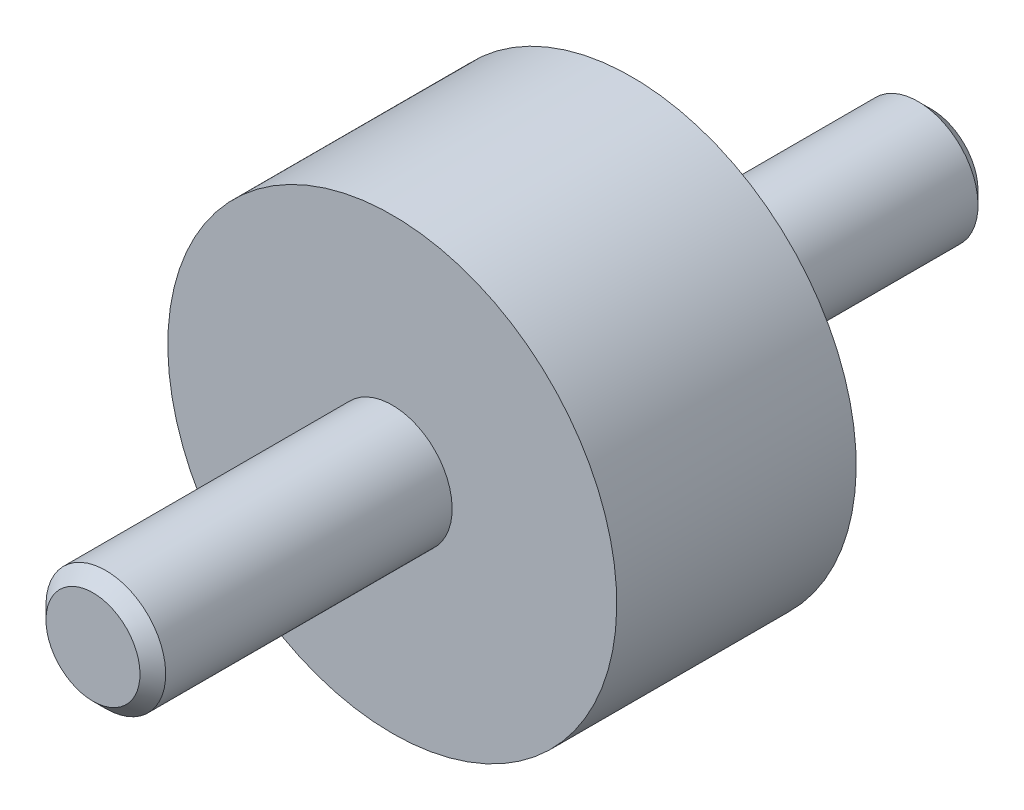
ISO-10303-21;
HEADER;
FILE_DESCRIPTION(('STEP AP214'),'2;1');
FILE_NAME('part.step','',(''),(''),'','','');
FILE_SCHEMA(('AUTOMOTIVE_DESIGN { 1 0 10303 214 1 1 1 1 }'));
ENDSEC;
DATA;
#1=APPLICATION_CONTEXT('core data for automotive mechanical design processes');
#2=APPLICATION_PROTOCOL_DEFINITION('international standard','automotive_design',2000,#1);
#3=PRODUCT_CONTEXT('',#1,'mechanical');
#4=PRODUCT('Part','Part','',(#3));
#5=PRODUCT_RELATED_PRODUCT_CATEGORY('part','',(#4));
#6=PRODUCT_DEFINITION_FORMATION('','',#4);
#7=PRODUCT_DEFINITION_CONTEXT('part definition',#1,'design');
#8=PRODUCT_DEFINITION('design','',#6,#7);
#9=PRODUCT_DEFINITION_SHAPE('','',#8);
#10=(LENGTH_UNIT() NAMED_UNIT(*) SI_UNIT(.MILLI.,.METRE.));
#11=(NAMED_UNIT(*) PLANE_ANGLE_UNIT() SI_UNIT($,.RADIAN.));
#12=(NAMED_UNIT(*) SI_UNIT($,.STERADIAN.) SOLID_ANGLE_UNIT());
#13=UNCERTAINTY_MEASURE_WITH_UNIT(LENGTH_MEASURE(1.E-05),#10,'distance_accuracy_value','');
#14=(GEOMETRIC_REPRESENTATION_CONTEXT(3) GLOBAL_UNCERTAINTY_ASSIGNED_CONTEXT((#13)) GLOBAL_UNIT_ASSIGNED_CONTEXT((#10,
#11,#12)) REPRESENTATION_CONTEXT('',''));
#15=CARTESIAN_POINT('',(0.,0.,0.));
#16=DIRECTION('',(0.,0.,1.));
#17=DIRECTION('',(1.,0.,0.));
#18=AXIS2_PLACEMENT_3D('',#15,#16,#17);
#19=CARTESIAN_POINT('',(7.,0.,8.));
#20=DIRECTION('',(0.,0.,1.));
#21=DIRECTION('',(0.,-1.,0.));
#22=AXIS2_PLACEMENT_3D('',#19,#20,#21);
#23=PLANE('',#22);
#24=CARTESIAN_POINT('',(0.,0.,8.));
#25=DIRECTION('',(0.,0.,1.));
#26=DIRECTION('',(0.,-1.,0.));
#27=AXIS2_PLACEMENT_3D('',#24,#25,#26);
#28=CIRCLE('',#27,2.);
#29=CARTESIAN_POINT('',(0.,-2.,8.));
#30=VERTEX_POINT('',#29);
#31=EDGE_CURVE('E8',#30,#30,#28,.T.);
#32=ORIENTED_EDGE('',*,*,#31,.F.);
#33=EDGE_LOOP('',(#32));
#34=FACE_BOUND('',#33,.T.);
#35=CARTESIAN_POINT('',(0.,0.,8.));
#36=DIRECTION('',(0.,0.,1.));
#37=DIRECTION('',(0.,-1.,0.));
#38=AXIS2_PLACEMENT_3D('',#35,#36,#37);
#39=CIRCLE('',#38,7.5);
#40=CARTESIAN_POINT('',(0.,-7.5,8.));
#41=VERTEX_POINT('',#40);
#42=EDGE_CURVE('E22',#41,#41,#39,.T.);
#43=ORIENTED_EDGE('',*,*,#42,.T.);
#44=EDGE_LOOP('',(#43));
#45=FACE_BOUND('',#44,.T.);
#46=ADVANCED_FACE('F12',(#34,#45),#23,.T.);
#47=CARTESIAN_POINT('',(0.,0.,0.26666666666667));
#48=DIRECTION('',(0.,0.,1.));
#49=DIRECTION('',(0.,-1.,0.));
#50=AXIS2_PLACEMENT_3D('',#47,#48,#49);
#51=CYLINDRICAL_SURFACE('',#50,7.5);
#52=CARTESIAN_POINT('',(0.,0.,0.));
#53=DIRECTION('',(0.,0.,1.));
#54=DIRECTION('',(0.,-1.,0.));
#55=AXIS2_PLACEMENT_3D('',#52,#53,#54);
#56=CIRCLE('',#55,7.5);
#57=CARTESIAN_POINT('',(0.,-7.5,0.));
#58=VERTEX_POINT('',#57);
#59=EDGE_CURVE('E26',#58,#58,#56,.T.);
#60=ORIENTED_EDGE('',*,*,#59,.T.);
#61=EDGE_LOOP('',(#60));
#62=FACE_BOUND('',#61,.T.);
#63=ORIENTED_EDGE('',*,*,#42,.F.);
#64=EDGE_LOOP('',(#63));
#65=FACE_BOUND('',#64,.T.);
#66=ADVANCED_FACE('F57',(#62,#65),#51,.T.);
#67=CARTESIAN_POINT('',(7.5,0.,0.));
#68=DIRECTION('',(0.,0.,-1.));
#69=DIRECTION('',(0.,1.,0.));
#70=AXIS2_PLACEMENT_3D('',#67,#68,#69);
#71=PLANE('',#70);
#72=CARTESIAN_POINT('',(0.,0.,0.));
#73=DIRECTION('',(0.,0.,-1.));
#74=DIRECTION('',(0.,1.,0.));
#75=AXIS2_PLACEMENT_3D('',#72,#73,#74);
#76=CIRCLE('',#75,2.);
#77=CARTESIAN_POINT('',(0.,2.,0.));
#78=VERTEX_POINT('',#77);
#79=EDGE_CURVE('E18',#78,#78,#76,.T.);
#80=ORIENTED_EDGE('',*,*,#79,.F.);
#81=EDGE_LOOP('',(#80));
#82=FACE_BOUND('',#81,.T.);
#83=ORIENTED_EDGE('',*,*,#59,.F.);
#84=EDGE_LOOP('',(#83));
#85=FACE_BOUND('',#84,.T.);
#86=ADVANCED_FACE('F62',(#82,#85),#71,.T.);
#87=CARTESIAN_POINT('',(0.,0.,-10.));
#88=DIRECTION('',(0.,0.,1.));
#89=DIRECTION('',(0.,-1.,0.));
#90=AXIS2_PLACEMENT_3D('',#87,#88,#89);
#91=CYLINDRICAL_SURFACE('',#90,2.);
#92=CARTESIAN_POINT('',(0.,0.,-9.5705));
#93=DIRECTION('',(0.,0.,1.));
#94=DIRECTION('',(0.,-1.,0.));
#95=AXIS2_PLACEMENT_3D('',#92,#93,#94);
#96=CIRCLE('',#95,2.);
#97=CARTESIAN_POINT('',(0.,-2.,-9.5705));
#98=VERTEX_POINT('',#97);
#99=EDGE_CURVE('E31',#98,#98,#96,.T.);
#100=ORIENTED_EDGE('',*,*,#99,.T.);
#101=EDGE_LOOP('',(#100));
#102=FACE_BOUND('',#101,.T.);
#103=ORIENTED_EDGE('',*,*,#79,.T.);
#104=EDGE_LOOP('',(#103));
#105=FACE_BOUND('',#104,.T.);
#106=ADVANCED_FACE('F70',(#102,#105),#91,.T.);
#107=CARTESIAN_POINT('',(0.,0.,-9.5705));
#108=DIRECTION('',(0.,0.,1.));
#109=DIRECTION('',(0.,-1.,0.));
#110=AXIS2_PLACEMENT_3D('',#107,#108,#109);
#111=CONICAL_SURFACE('',#110,2.,0.785398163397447);
#112=CARTESIAN_POINT('',(0.,0.,-10.));
#113=DIRECTION('',(0.,0.,1.));
#114=DIRECTION('',(0.,-1.,0.));
#115=AXIS2_PLACEMENT_3D('',#112,#113,#114);
#116=CIRCLE('',#115,1.5705);
#117=CARTESIAN_POINT('',(0.,-1.5705,-10.));
#118=VERTEX_POINT('',#117);
#119=EDGE_CURVE('E34',#118,#118,#116,.T.);
#120=ORIENTED_EDGE('',*,*,#119,.T.);
#121=EDGE_LOOP('',(#120));
#122=FACE_BOUND('',#121,.T.);
#123=ORIENTED_EDGE('',*,*,#99,.F.);
#124=EDGE_LOOP('',(#123));
#125=FACE_BOUND('',#124,.T.);
#126=ADVANCED_FACE('F76',(#122,#125),#111,.T.);
#127=CARTESIAN_POINT('',(1.5705,0.,-10.));
#128=DIRECTION('',(0.,0.,-1.));
#129=DIRECTION('',(0.,1.,0.));
#130=AXIS2_PLACEMENT_3D('',#127,#128,#129);
#131=PLANE('',#130);
#132=ORIENTED_EDGE('',*,*,#119,.F.);
#133=EDGE_LOOP('',(#132));
#134=FACE_BOUND('',#133,.T.);
#135=ADVANCED_FACE('F80',(#134),#131,.T.);
#136=CARTESIAN_POINT('',(0.,0.,18.));
#137=DIRECTION('',(0.,0.,1.));
#138=DIRECTION('',(0.,-1.,0.));
#139=AXIS2_PLACEMENT_3D('',#136,#137,#138);
#140=PLANE('',#139);
#141=CARTESIAN_POINT('',(0.,0.,18.));
#142=DIRECTION('',(0.,0.,1.));
#143=DIRECTION('',(0.,-1.,0.));
#144=AXIS2_PLACEMENT_3D('',#141,#142,#143);
#145=CIRCLE('',#144,1.5705);
#146=CARTESIAN_POINT('',(0.,-1.5705,18.));
#147=VERTEX_POINT('',#146);
#148=EDGE_CURVE('E37',#147,#147,#145,.T.);
#149=ORIENTED_EDGE('',*,*,#148,.T.);
#150=EDGE_LOOP('',(#149));
#151=FACE_BOUND('',#150,.T.);
#152=ADVANCED_FACE('F54',(#151),#140,.T.);
#153=CARTESIAN_POINT('',(0.,0.,18.));
#154=DIRECTION('',(0.,0.,-1.));
#155=DIRECTION('',(0.,1.,0.));
#156=AXIS2_PLACEMENT_3D('',#153,#154,#155);
#157=CONICAL_SURFACE('',#156,1.5705,0.785398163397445);
#158=CARTESIAN_POINT('',(0.,0.,17.5705));
#159=DIRECTION('',(0.,0.,1.));
#160=DIRECTION('',(0.,-1.,0.));
#161=AXIS2_PLACEMENT_3D('',#158,#159,#160);
#162=CIRCLE('',#161,2.);
#163=CARTESIAN_POINT('',(0.,-2.,17.5705));
#164=VERTEX_POINT('',#163);
#165=EDGE_CURVE('E40',#164,#164,#162,.T.);
#166=ORIENTED_EDGE('',*,*,#165,.T.);
#167=EDGE_LOOP('',(#166));
#168=FACE_BOUND('',#167,.T.);
#169=ORIENTED_EDGE('',*,*,#148,.F.);
#170=EDGE_LOOP('',(#169));
#171=FACE_BOUND('',#170,.T.);
#172=ADVANCED_FACE('F44',(#168,#171),#157,.T.);
#173=CARTESIAN_POINT('',(0.,0.,8.));
#174=DIRECTION('',(0.,0.,1.));
#175=DIRECTION('',(0.,-1.,0.));
#176=AXIS2_PLACEMENT_3D('',#173,#174,#175);
#177=CYLINDRICAL_SURFACE('',#176,2.);
#178=ORIENTED_EDGE('',*,*,#31,.T.);
#179=EDGE_LOOP('',(#178));
#180=FACE_BOUND('',#179,.T.);
#181=ORIENTED_EDGE('',*,*,#165,.F.);
#182=EDGE_LOOP('',(#181));
#183=FACE_BOUND('',#182,.T.);
#184=ADVANCED_FACE('F47',(#180,#183),#177,.T.);
#185=CLOSED_SHELL('',(#46,#66,#86,#106,#126,#135,#152,#172,#184));
#186=MANIFOLD_SOLID_BREP('B1',#185);
#187=ADVANCED_BREP_SHAPE_REPRESENTATION('',(#18,#186),#14);
#188=SHAPE_DEFINITION_REPRESENTATION(#9,#187);
ENDSEC;
END-ISO-10303-21;
